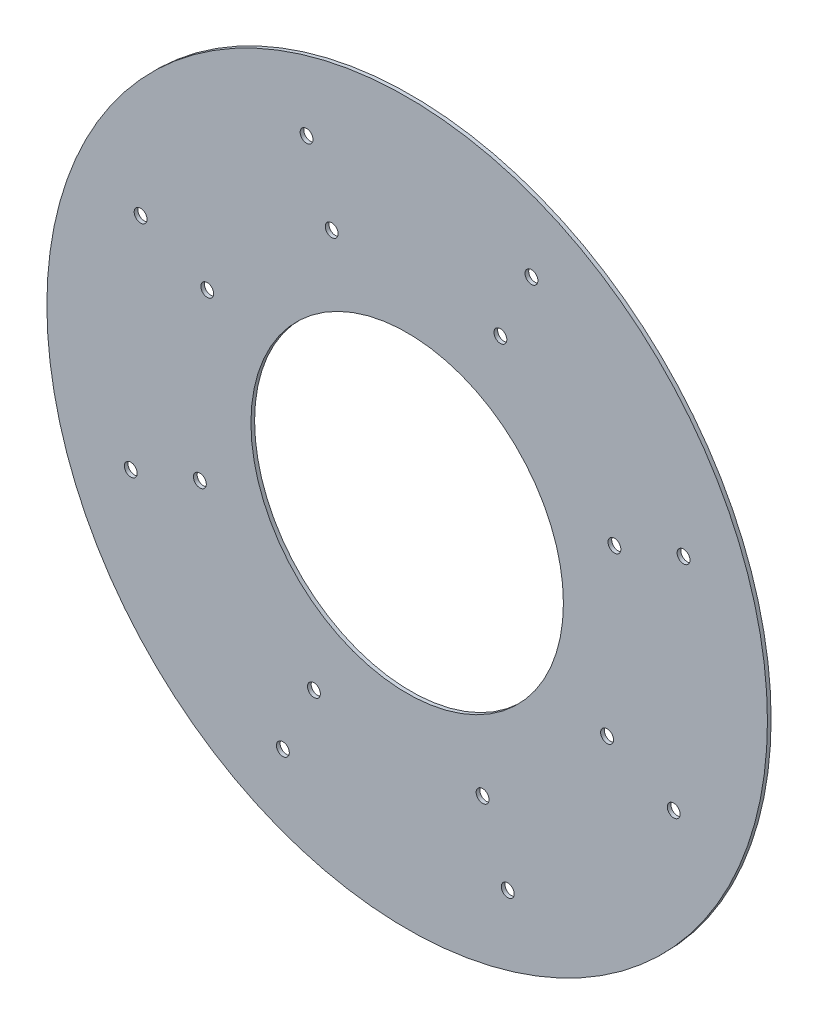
from build123d import *

# Parameters (mm, degrees)
ESQUISSE1_R                  = 980
ESQUISSE1_R_2                = 425
BOSS_EXTRU_1_DEPTH           = 10
ESQUISSE2_R                  = 17.5
ENL_V_MAT_EXTRU_1_DEPTH      = 1386.965367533
R_P_TITION_CIRCULAIRE1_COUNT = 8


with BuildPart() as part:
    # Esquisse1 → Boss.-Extru.1 (new body)
    with BuildSketch(Plane.XY):
        Circle(ESQUISSE1_R)
        Circle(ESQUISSE1_R_2, mode=Mode.SUBTRACT)
    extrude(amount=BOSS_EXTRU_1_DEPTH)

    # Esquisse2 → Enl_v. mat.-Extru.1 (cut, through all)
    with BuildSketch(Plane.XY.offset(10)):
        with Locations((-253.570957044, -543.784672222)):
            Circle(ESQUISSE2_R)
        with Locations((-338.094609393, -725.046229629)):
            Circle(ESQUISSE2_R)
    enl_v_mat_extru_1 = extrude(amount=-ENL_V_MAT_EXTRU_1_DEPTH, mode=Mode.SUBTRACT)

    # R_p_tition circulaire1: Enl_v. mat.-Extru.1 ×8 about axis
    r_p_tition_circulaire1_axis = Axis((0, 0, 0), (0, 0, 1))
    for i in range(1, R_P_TITION_CIRCULAIRE1_COUNT):
        add(enl_v_mat_extru_1.rotate(r_p_tition_circulaire1_axis, i * 360 / R_P_TITION_CIRCULAIRE1_COUNT), mode=Mode.SUBTRACT)


solid = part.part
